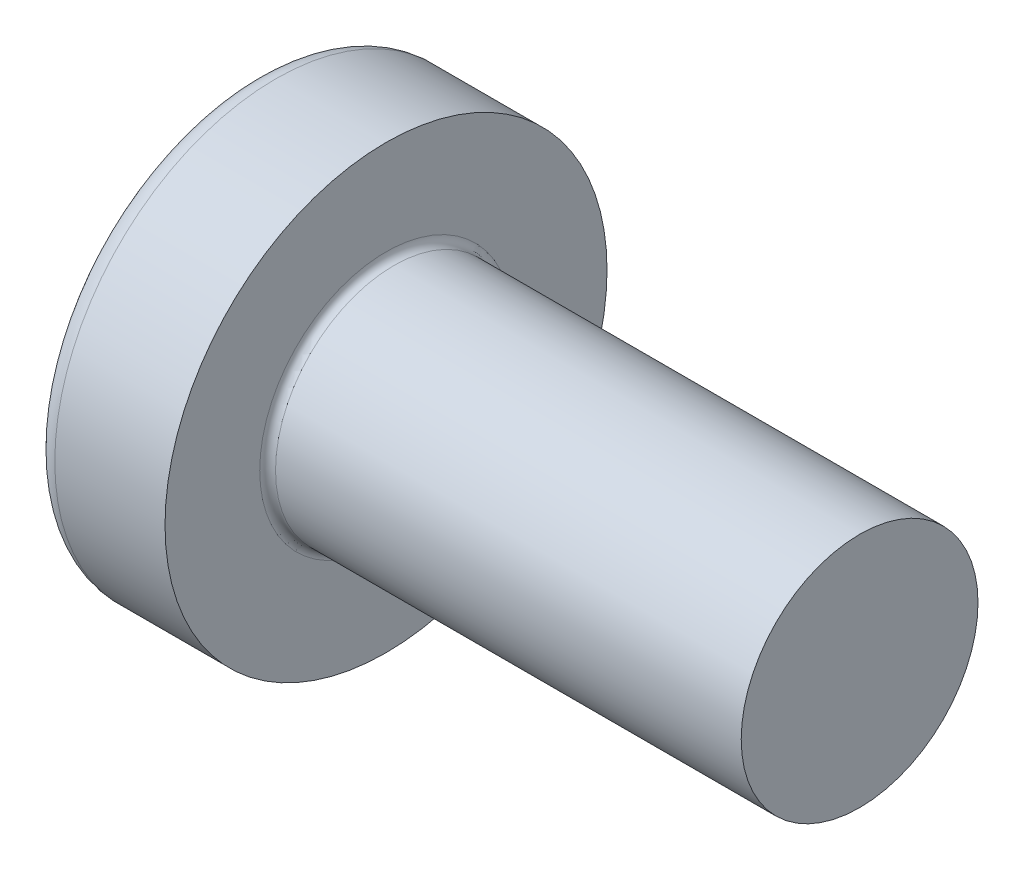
from build123d import *

# Parameters (mm, degrees)
FILLET1_R    = 0.1
RECPAT_COUNT = 2
RECPAT_ANGLE = 90


with BuildPart() as part:
    # BodySke → Base-Revolve (revolve)
    with BuildSketch(Plane.XY, mode=Mode.PRIVATE) as base_revolve_sk:
        with BuildLine():
            Line((2.4, 1.5), (2.4, 2.8))
            Line((2.4, 2.8), (1.003501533, 2.8))
            ThreePointArc((1.003501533, 2.8), (0.873295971, 2.76653015), (0.775371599, 2.674418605))
            ThreePointArc((0.775371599, 2.674418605), (0.197753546, 1.392274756), (0, 0))
            Line((0, 0), (8.4, 0))
            Line((8.4, 0), (8.4, 1.5))
            Line((8.4, 1.5), (2.4, 1.5))
        make_face()
    revolve(base_revolve_sk.sketch.rotate(Axis((1.003501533, 0, 0), (1, 0, 0)), 90), axis=Axis((1.003501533, 0, 0), (1, 0, 0)))

    # Fillet1
    fillet1_edges = [part.edges().sort_by_distance(p)[0] for p in [
        (2.4, 0, -1.5),
    ]]
    fillet(fillet1_edges, radius=FILLET1_R)

    # Sketch3 → Recess section 0
    with BuildSketch(Plane(origin=(0, 0, 0), x_dir=(0, 0, -1), z_dir=(1, 0, 0))):
        with BuildLine():
            Line((0.37, -1.4), (-0.37, -1.4))
            Line((-0.37, -1.4), (-0.37, 1.4))
            Line((-0.37, 1.4), (0.37, 1.4))
            Line((0.37, 1.4), (0.37, -1.4))
        make_face()
    # Sketch4 → Recess section 1
    with BuildSketch(Plane(origin=(1.75, 0, 0), x_dir=(0, 0, -1), z_dir=(1, 0, 0))):
        with BuildLine():
            Line((0.37, -0.527482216), (-0.37, -0.527482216))
            Line((-0.37, -0.527482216), (-0.37, 0.527482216))
            Line((-0.37, 0.527482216), (0.37, 0.527482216))
            Line((0.37, 0.527482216), (0.37, -0.527482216))
        make_face()
    recess = loft(mode=Mode.SUBTRACT)

    # RecPat: Recess ×2 about axis
    recpat_axis = Axis((0, 0, 0), (1, 0, 0))
    for i in range(1, RECPAT_COUNT):
        add(recess.rotate(recpat_axis, i * RECPAT_ANGLE / (RECPAT_COUNT - 1)), mode=Mode.SUBTRACT)

    # RecCorSke → RecessCore (revolve, cut)
    with BuildSketch(Plane.XY, mode=Mode.PRIVATE) as recesscore_sk:
        Polygon((0, 0), (0, 0.678371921), (1.75, 0.556), (1.930655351, 0), align=None)
    revolve(recesscore_sk.sketch.rotate(Axis((-3.175, 0, 0), (1, 0, 0)), 15.814025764), axis=Axis((-3.175, 0, 0), (1, 0, 0)), mode=Mode.SUBTRACT)


solid = part.part
